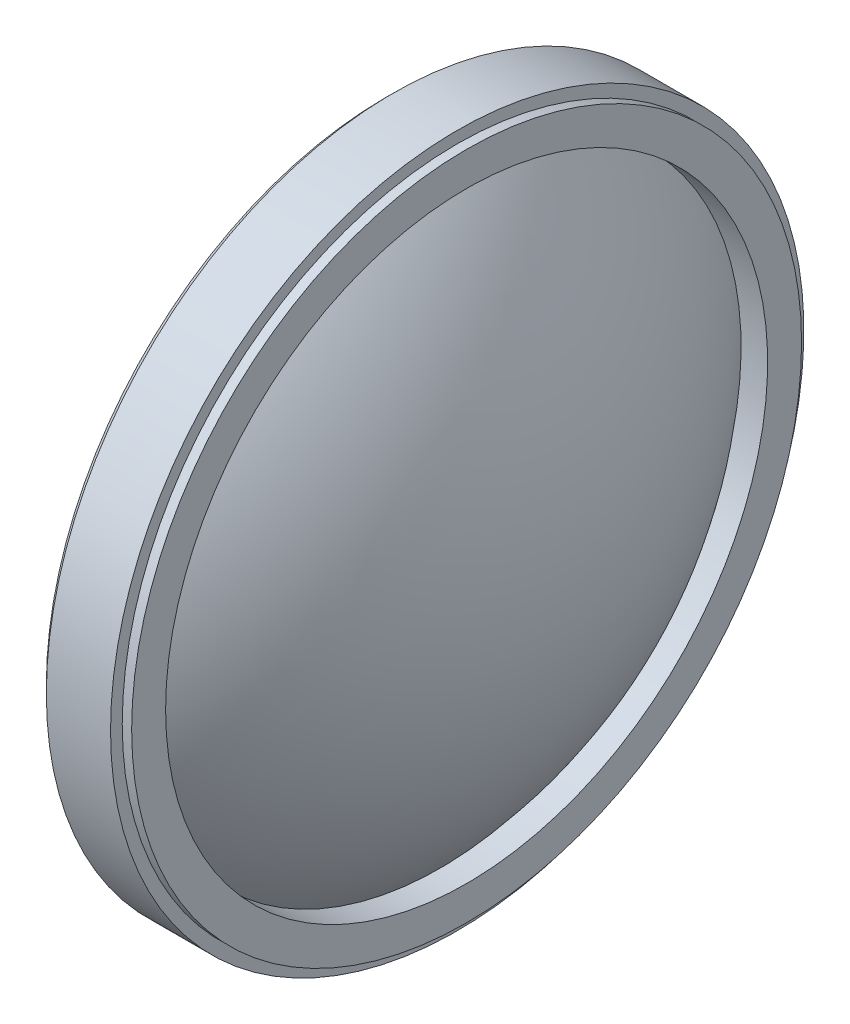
from build123d import *

# Parameters (mm, degrees)
CHAMFER1_SIZE = 0.25


with BuildPart() as part:
    # Sketch1 → Revolve1 (revolve)
    with BuildSketch(Plane.XY, mode=Mode.PRIVATE) as revolve1_sk:
        with BuildLine():
            ThreePointArc((0, 10.55), (2.23542227, 5.484124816), (3, 0))
            Line((3, 0), (5.9, 0))
            ThreePointArc((5.9, 0), (4.866434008, 5.641420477), (1.9, 10.55))
            Line((1.9, 10.55), (2.83, 10.55))
            Line((2.83, 10.55), (2.83, 11.74))
            Line((2.83, 11.74), (2.5, 11.74))
            Line((2.5, 11.74), (2.5, 12.15))
            Line((2.5, 12.15), (0, 12.15))
            Line((0, 12.15), (0, 10.55))
        make_face()
    revolve(revolve1_sk.sketch.rotate(Axis((-3.907191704, 0, 0), (1, 0, 0)), 90), axis=Axis((-3.907191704, 0, 0), (1, 0, 0)))

    # Chamfer1
    chamfer1_edges = [part.edges().sort_by_distance(p)[0] for p in [
        (0, 0, -12.15),
    ]]
    chamfer(chamfer1_edges, length=CHAMFER1_SIZE)


solid = part.part
